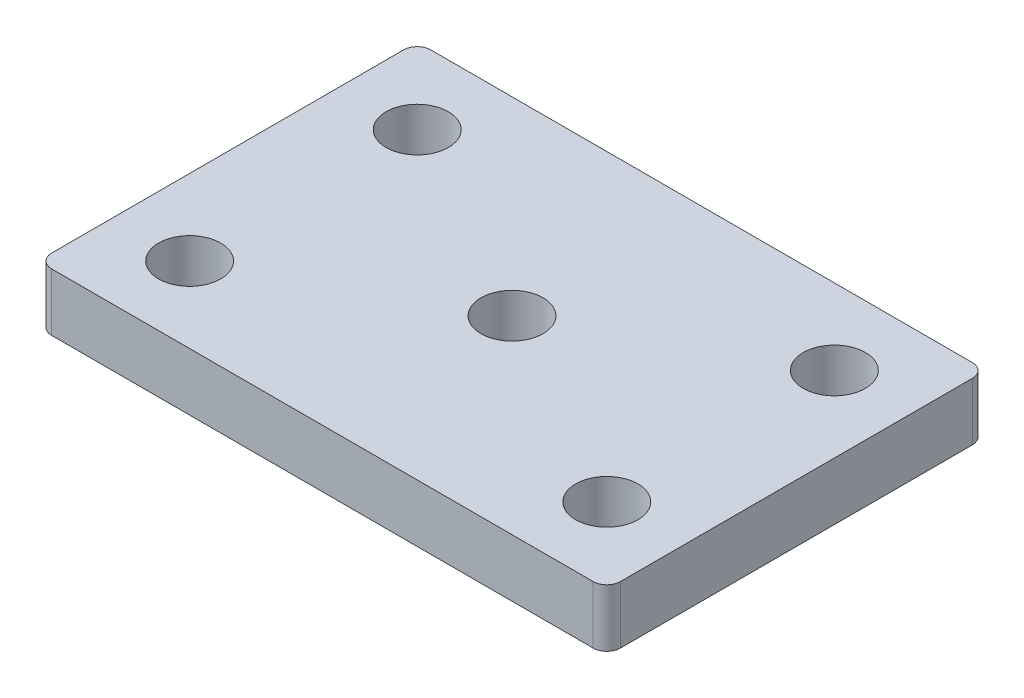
from build123d import *

# Parameters (mm, degrees)
SKETCH1_W      = 95.25
SKETCH1_H      = 63.5
SKETCH1_R      = 5.207
EXTRUDE1_DEPTH = 9.652
FILLET1_R      = 2.286


with BuildPart() as part:
    # Sketch1 → Extrude1 (new body)
    with BuildSketch(Plane(origin=(0, 0, 0), x_dir=(1, 0, 0), z_dir=(0, 1, 0))):
        Rectangle(SKETCH1_W, SKETCH1_H)
        with Locations(Location((-34.925, 19.05, 0), (0, 0, 270))):
            Circle(SKETCH1_R, mode=Mode.SUBTRACT)
        with Locations(Location((0, 0, 0), (0, 0, 270))):
            Circle(SKETCH1_R, mode=Mode.SUBTRACT)
        with Locations(Location((34.925, -19.05, 0), (0, 0, 270))):
            Circle(SKETCH1_R, mode=Mode.SUBTRACT)
        with Locations(Location((34.925, 19.05, 0), (0, 0, 270))):
            Circle(SKETCH1_R, mode=Mode.SUBTRACT)
        with Locations(Location((-34.925, -19.05, 0), (0, 0, 270))):
            Circle(SKETCH1_R, mode=Mode.SUBTRACT)
    extrude(amount=EXTRUDE1_DEPTH)

    # Fillet1
    fillet1_edges = [part.edges().sort_by_distance(p)[0] for p in [
        (-47.625, 4.826, -31.75),
        (47.625, 4.826, -31.75),
        (47.625, 4.826, 31.75),
        (-47.625, 4.826, 31.75),
    ]]
    fillet(fillet1_edges, radius=FILLET1_R)


solid = part.part
